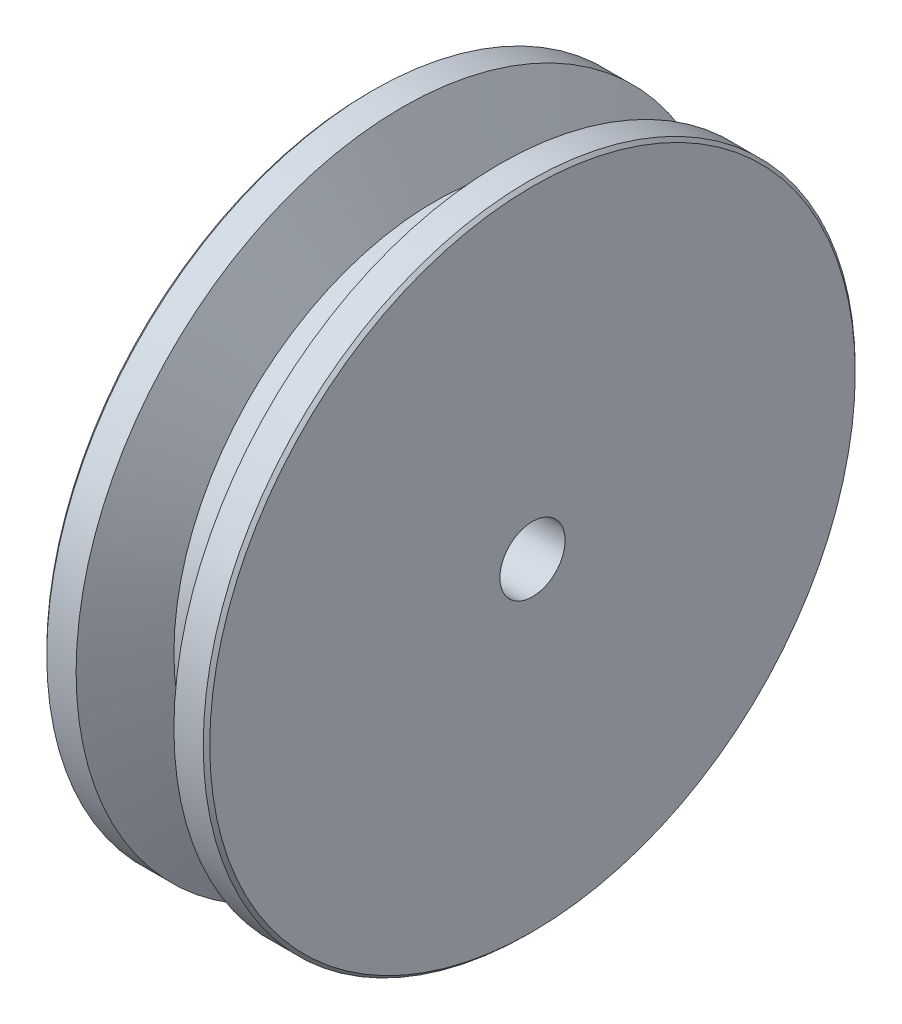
ISO-10303-21;
HEADER;
FILE_DESCRIPTION(('STEP AP214'),'2;1');
FILE_NAME('part.step','',(''),(''),'','','');
FILE_SCHEMA(('AUTOMOTIVE_DESIGN { 1 0 10303 214 1 1 1 1 }'));
ENDSEC;
DATA;
#1=APPLICATION_CONTEXT('core data for automotive mechanical design processes');
#2=APPLICATION_PROTOCOL_DEFINITION('international standard','automotive_design',2000,#1);
#3=PRODUCT_CONTEXT('',#1,'mechanical');
#4=PRODUCT('Part','Part','',(#3));
#5=PRODUCT_RELATED_PRODUCT_CATEGORY('part','',(#4));
#6=PRODUCT_DEFINITION_FORMATION('','',#4);
#7=PRODUCT_DEFINITION_CONTEXT('part definition',#1,'design');
#8=PRODUCT_DEFINITION('design','',#6,#7);
#9=PRODUCT_DEFINITION_SHAPE('','',#8);
#10=(LENGTH_UNIT() NAMED_UNIT(*) SI_UNIT(.MILLI.,.METRE.));
#11=(NAMED_UNIT(*) PLANE_ANGLE_UNIT() SI_UNIT($,.RADIAN.));
#12=(NAMED_UNIT(*) SI_UNIT($,.STERADIAN.) SOLID_ANGLE_UNIT());
#13=UNCERTAINTY_MEASURE_WITH_UNIT(LENGTH_MEASURE(1.E-05),#10,'distance_accuracy_value','');
#14=(GEOMETRIC_REPRESENTATION_CONTEXT(3) GLOBAL_UNCERTAINTY_ASSIGNED_CONTEXT((#13)) GLOBAL_UNIT_ASSIGNED_CONTEXT((#10,
#11,#12)) REPRESENTATION_CONTEXT('',''));
#15=CARTESIAN_POINT('',(0.,0.,0.));
#16=DIRECTION('',(0.,0.,1.));
#17=DIRECTION('',(1.,0.,0.));
#18=AXIS2_PLACEMENT_3D('',#15,#16,#17);
#19=CARTESIAN_POINT('',(-74.0742811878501,0.,0.));
#20=DIRECTION('',(-1.,0.,0.));
#21=DIRECTION('',(0.,0.,1.));
#22=AXIS2_PLACEMENT_3D('',#19,#20,#21);
#23=CYLINDRICAL_SURFACE('',#22,100.);
#24=CARTESIAN_POINT('',(1.00000000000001,0.,0.));
#25=DIRECTION('',(1.,0.,0.));
#26=DIRECTION('',(0.,0.,-1.));
#27=AXIS2_PLACEMENT_3D('',#24,#25,#26);
#28=CIRCLE('',#27,100.);
#29=CARTESIAN_POINT('',(1.00000000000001,0.,-100.));
#30=VERTEX_POINT('',#29);
#31=EDGE_CURVE('E49',#30,#30,#28,.T.);
#32=ORIENTED_EDGE('',*,*,#31,.T.);
#33=EDGE_LOOP('',(#32));
#34=FACE_BOUND('',#33,.T.);
#35=CARTESIAN_POINT('',(9.99999999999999,0.,0.));
#36=DIRECTION('',(-1.,0.,0.));
#37=DIRECTION('',(0.,0.,1.));
#38=AXIS2_PLACEMENT_3D('',#35,#36,#37);
#39=CIRCLE('',#38,100.);
#40=CARTESIAN_POINT('',(9.99999999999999,0.,100.));
#41=VERTEX_POINT('',#40);
#42=EDGE_CURVE('E55',#41,#41,#39,.T.);
#43=ORIENTED_EDGE('',*,*,#42,.T.);
#44=EDGE_LOOP('',(#43));
#45=FACE_BOUND('',#44,.T.);
#46=ADVANCED_FACE('F29',(#34,#45),#23,.T.);
#47=CARTESIAN_POINT('',(20.,0.,0.));
#48=DIRECTION('',(-1.,0.,0.));
#49=DIRECTION('',(0.,0.,1.));
#50=AXIS2_PLACEMENT_3D('',#47,#48,#49);
#51=CONICAL_SURFACE('',#50,80.,1.10714871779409);
#52=ORIENTED_EDGE('',*,*,#42,.F.);
#53=EDGE_LOOP('',(#52));
#54=FACE_BOUND('',#53,.T.);
#55=CARTESIAN_POINT('',(20.,0.,0.));
#56=DIRECTION('',(-1.,0.,0.));
#57=DIRECTION('',(0.,0.,1.));
#58=AXIS2_PLACEMENT_3D('',#55,#56,#57);
#59=CIRCLE('',#58,80.);
#60=CARTESIAN_POINT('',(20.,0.,80.));
#61=VERTEX_POINT('',#60);
#62=EDGE_CURVE('E58',#61,#61,#59,.T.);
#63=ORIENTED_EDGE('',*,*,#62,.T.);
#64=EDGE_LOOP('',(#63));
#65=FACE_BOUND('',#64,.T.);
#66=ADVANCED_FACE('F94',(#54,#65),#51,.T.);
#67=CARTESIAN_POINT('',(-74.0742811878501,0.,0.));
#68=DIRECTION('',(-1.,0.,0.));
#69=DIRECTION('',(0.,0.,1.));
#70=AXIS2_PLACEMENT_3D('',#67,#68,#69);
#71=CYLINDRICAL_SURFACE('',#70,80.);
#72=ORIENTED_EDGE('',*,*,#62,.F.);
#73=EDGE_LOOP('',(#72));
#74=FACE_BOUND('',#73,.T.);
#75=CARTESIAN_POINT('',(30.,0.,0.));
#76=DIRECTION('',(-1.,0.,0.));
#77=DIRECTION('',(0.,0.,1.));
#78=AXIS2_PLACEMENT_3D('',#75,#76,#77);
#79=CIRCLE('',#78,80.);
#80=CARTESIAN_POINT('',(30.,0.,80.));
#81=VERTEX_POINT('',#80);
#82=EDGE_CURVE('E61',#81,#81,#79,.T.);
#83=ORIENTED_EDGE('',*,*,#82,.T.);
#84=EDGE_LOOP('',(#83));
#85=FACE_BOUND('',#84,.T.);
#86=ADVANCED_FACE('F100',(#74,#85),#71,.T.);
#87=CARTESIAN_POINT('',(40.,0.,0.));
#88=DIRECTION('',(1.,0.,0.));
#89=DIRECTION('',(0.,0.,-1.));
#90=AXIS2_PLACEMENT_3D('',#87,#88,#89);
#91=CONICAL_SURFACE('',#90,100.,1.10714871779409);
#92=ORIENTED_EDGE('',*,*,#82,.F.);
#93=EDGE_LOOP('',(#92));
#94=FACE_BOUND('',#93,.T.);
#95=CARTESIAN_POINT('',(40.,0.,0.));
#96=DIRECTION('',(-1.,0.,0.));
#97=DIRECTION('',(0.,0.,1.));
#98=AXIS2_PLACEMENT_3D('',#95,#96,#97);
#99=CIRCLE('',#98,100.);
#100=CARTESIAN_POINT('',(40.,0.,100.));
#101=VERTEX_POINT('',#100);
#102=EDGE_CURVE('E64',#101,#101,#99,.T.);
#103=ORIENTED_EDGE('',*,*,#102,.T.);
#104=EDGE_LOOP('',(#103));
#105=FACE_BOUND('',#104,.T.);
#106=ADVANCED_FACE('F119',(#94,#105),#91,.T.);
#107=CARTESIAN_POINT('',(-74.0742811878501,0.,0.));
#108=DIRECTION('',(-1.,0.,0.));
#109=DIRECTION('',(0.,0.,1.));
#110=AXIS2_PLACEMENT_3D('',#107,#108,#109);
#111=CYLINDRICAL_SURFACE('',#110,100.);
#112=CARTESIAN_POINT('',(49.0000000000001,0.,0.));
#113=DIRECTION('',(-1.,0.,0.));
#114=DIRECTION('',(0.,0.,1.));
#115=AXIS2_PLACEMENT_3D('',#112,#113,#114);
#116=CIRCLE('',#115,100.);
#117=CARTESIAN_POINT('',(49.0000000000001,0.,100.));
#118=VERTEX_POINT('',#117);
#119=EDGE_CURVE('E44',#118,#118,#116,.T.);
#120=ORIENTED_EDGE('',*,*,#119,.T.);
#121=EDGE_LOOP('',(#120));
#122=FACE_BOUND('',#121,.T.);
#123=ORIENTED_EDGE('',*,*,#102,.F.);
#124=EDGE_LOOP('',(#123));
#125=FACE_BOUND('',#124,.T.);
#126=ADVANCED_FACE('F115',(#122,#125),#111,.T.);
#127=CARTESIAN_POINT('',(50.,10.,0.));
#128=DIRECTION('',(-1.,0.,0.));
#129=DIRECTION('',(0.,0.,1.));
#130=AXIS2_PLACEMENT_3D('',#127,#128,#129);
#131=PLANE('',#130);
#132=CARTESIAN_POINT('',(50.,0.,0.));
#133=DIRECTION('',(-1.,0.,0.));
#134=DIRECTION('',(0.,0.,1.));
#135=AXIS2_PLACEMENT_3D('',#132,#133,#134);
#136=CIRCLE('',#135,99.0000000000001);
#137=CARTESIAN_POINT('',(50.,0.,99.0000000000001));
#138=VERTEX_POINT('',#137);
#139=EDGE_CURVE('E40',#138,#138,#136,.F.);
#140=ORIENTED_EDGE('',*,*,#139,.T.);
#141=EDGE_LOOP('',(#140));
#142=FACE_BOUND('',#141,.T.);
#143=CARTESIAN_POINT('',(50.,0.,0.));
#144=DIRECTION('',(-1.,0.,0.));
#145=DIRECTION('',(0.,0.,1.));
#146=AXIS2_PLACEMENT_3D('',#143,#144,#145);
#147=CIRCLE('',#146,10.);
#148=CARTESIAN_POINT('',(50.,0.,10.));
#149=VERTEX_POINT('',#148);
#150=EDGE_CURVE('E67',#149,#149,#147,.T.);
#151=ORIENTED_EDGE('',*,*,#150,.T.);
#152=EDGE_LOOP('',(#151));
#153=FACE_BOUND('',#152,.T.);
#154=ADVANCED_FACE('F118',(#142,#153),#131,.F.);
#155=CARTESIAN_POINT('',(-74.0742811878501,0.,0.));
#156=DIRECTION('',(-1.,0.,0.));
#157=DIRECTION('',(0.,0.,1.));
#158=AXIS2_PLACEMENT_3D('',#155,#156,#157);
#159=CYLINDRICAL_SURFACE('',#158,10.);
#160=ORIENTED_EDGE('',*,*,#150,.F.);
#161=EDGE_LOOP('',(#160));
#162=FACE_BOUND('',#161,.T.);
#163=CARTESIAN_POINT('',(-30.,0.,0.));
#164=DIRECTION('',(-1.,0.,0.));
#165=DIRECTION('',(0.,0.,1.));
#166=AXIS2_PLACEMENT_3D('',#163,#164,#165);
#167=CIRCLE('',#166,10.);
#168=CARTESIAN_POINT('',(-30.,0.,10.));
#169=VERTEX_POINT('',#168);
#170=EDGE_CURVE('E70',#169,#169,#167,.T.);
#171=ORIENTED_EDGE('',*,*,#170,.T.);
#172=EDGE_LOOP('',(#171));
#173=FACE_BOUND('',#172,.T.);
#174=ADVANCED_FACE('F134',(#162,#173),#159,.F.);
#175=CARTESIAN_POINT('',(-30.,40.,0.));
#176=DIRECTION('',(1.,0.,0.));
#177=DIRECTION('',(0.,0.,-1.));
#178=AXIS2_PLACEMENT_3D('',#175,#176,#177);
#179=PLANE('',#178);
#180=CARTESIAN_POINT('',(-30.,0.,0.));
#181=DIRECTION('',(1.,0.,0.));
#182=DIRECTION('',(0.,0.,-1.));
#183=AXIS2_PLACEMENT_3D('',#180,#181,#182);
#184=CIRCLE('',#183,35.);
#185=CARTESIAN_POINT('',(-30.,0.,-35.));
#186=VERTEX_POINT('',#185);
#187=EDGE_CURVE('E36',#186,#186,#184,.F.);
#188=ORIENTED_EDGE('',*,*,#187,.T.);
#189=EDGE_LOOP('',(#188));
#190=FACE_BOUND('',#189,.T.);
#191=ORIENTED_EDGE('',*,*,#170,.F.);
#192=EDGE_LOOP('',(#191));
#193=FACE_BOUND('',#192,.T.);
#194=ADVANCED_FACE('F91',(#190,#193),#179,.F.);
#195=CARTESIAN_POINT('',(-74.0742811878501,0.,0.));
#196=DIRECTION('',(-1.,0.,0.));
#197=DIRECTION('',(0.,0.,1.));
#198=AXIS2_PLACEMENT_3D('',#195,#196,#197);
#199=CYLINDRICAL_SURFACE('',#198,40.);
#200=CARTESIAN_POINT('',(-25.,0.,0.));
#201=DIRECTION('',(1.,0.,0.));
#202=DIRECTION('',(0.,0.,-1.));
#203=AXIS2_PLACEMENT_3D('',#200,#201,#202);
#204=CIRCLE('',#203,40.);
#205=CARTESIAN_POINT('',(-25.,0.,-40.));
#206=VERTEX_POINT('',#205);
#207=EDGE_CURVE('E10',#206,#206,#204,.T.);
#208=ORIENTED_EDGE('',*,*,#207,.T.);
#209=EDGE_LOOP('',(#208));
#210=FACE_BOUND('',#209,.T.);
#211=CARTESIAN_POINT('',(0.,0.,0.));
#212=DIRECTION('',(-1.,0.,0.));
#213=DIRECTION('',(0.,0.,1.));
#214=AXIS2_PLACEMENT_3D('',#211,#212,#213);
#215=CIRCLE('',#214,40.);
#216=CARTESIAN_POINT('',(0.,0.,40.));
#217=VERTEX_POINT('',#216);
#218=EDGE_CURVE('E73',#217,#217,#215,.T.);
#219=ORIENTED_EDGE('',*,*,#218,.T.);
#220=EDGE_LOOP('',(#219));
#221=FACE_BOUND('',#220,.T.);
#222=ADVANCED_FACE('F77',(#210,#221),#199,.T.);
#223=CARTESIAN_POINT('',(0.,100.,0.));
#224=DIRECTION('',(1.,0.,0.));
#225=DIRECTION('',(0.,0.,-1.));
#226=AXIS2_PLACEMENT_3D('',#223,#224,#225);
#227=PLANE('',#226);
#228=CARTESIAN_POINT('',(0.,0.,0.));
#229=DIRECTION('',(1.,0.,0.));
#230=DIRECTION('',(0.,0.,-1.));
#231=AXIS2_PLACEMENT_3D('',#228,#229,#230);
#232=CIRCLE('',#231,99.);
#233=CARTESIAN_POINT('',(0.,0.,-99.));
#234=VERTEX_POINT('',#233);
#235=EDGE_CURVE('E52',#234,#234,#232,.F.);
#236=ORIENTED_EDGE('',*,*,#235,.T.);
#237=EDGE_LOOP('',(#236));
#238=FACE_BOUND('',#237,.T.);
#239=ORIENTED_EDGE('',*,*,#218,.F.);
#240=EDGE_LOOP('',(#239));
#241=FACE_BOUND('',#240,.T.);
#242=ADVANCED_FACE('F79',(#238,#241),#227,.F.);
#243=CARTESIAN_POINT('',(0.,0.,0.));
#244=DIRECTION('',(1.,0.,0.));
#245=DIRECTION('',(0.,0.,-1.));
#246=AXIS2_PLACEMENT_3D('',#243,#244,#245);
#247=CONICAL_SURFACE('',#246,99.,0.785398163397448);
#248=ORIENTED_EDGE('',*,*,#31,.F.);
#249=EDGE_LOOP('',(#248));
#250=FACE_BOUND('',#249,.T.);
#251=ORIENTED_EDGE('',*,*,#235,.F.);
#252=EDGE_LOOP('',(#251));
#253=FACE_BOUND('',#252,.T.);
#254=ADVANCED_FACE('F81',(#250,#253),#247,.T.);
#255=CARTESIAN_POINT('',(49.0000000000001,0.,0.));
#256=DIRECTION('',(-1.,0.,0.));
#257=DIRECTION('',(0.,0.,1.));
#258=AXIS2_PLACEMENT_3D('',#255,#256,#257);
#259=CONICAL_SURFACE('',#258,100.,0.785398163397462);
#260=ORIENTED_EDGE('',*,*,#139,.F.);
#261=EDGE_LOOP('',(#260));
#262=FACE_BOUND('',#261,.T.);
#263=ORIENTED_EDGE('',*,*,#119,.F.);
#264=EDGE_LOOP('',(#263));
#265=FACE_BOUND('',#264,.T.);
#266=ADVANCED_FACE('F88',(#262,#265),#259,.T.);
#267=CARTESIAN_POINT('',(-30.,0.,0.));
#268=DIRECTION('',(1.,0.,0.));
#269=DIRECTION('',(0.,0.,-1.));
#270=AXIS2_PLACEMENT_3D('',#267,#268,#269);
#271=CONICAL_SURFACE('',#270,35.,0.785398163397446);
#272=ORIENTED_EDGE('',*,*,#207,.F.);
#273=EDGE_LOOP('',(#272));
#274=FACE_BOUND('',#273,.T.);
#275=ORIENTED_EDGE('',*,*,#187,.F.);
#276=EDGE_LOOP('',(#275));
#277=FACE_BOUND('',#276,.T.);
#278=ADVANCED_FACE('F31',(#274,#277),#271,.T.);
#279=CLOSED_SHELL('',(#46,#66,#86,#106,#126,#154,#174,#194,#222,#242,#254,#266,#278));
#280=MANIFOLD_SOLID_BREP('B2',#279);
#281=ADVANCED_BREP_SHAPE_REPRESENTATION('',(#18,#280),#14);
#282=SHAPE_DEFINITION_REPRESENTATION(#9,#281);
ENDSEC;
END-ISO-10303-21;
